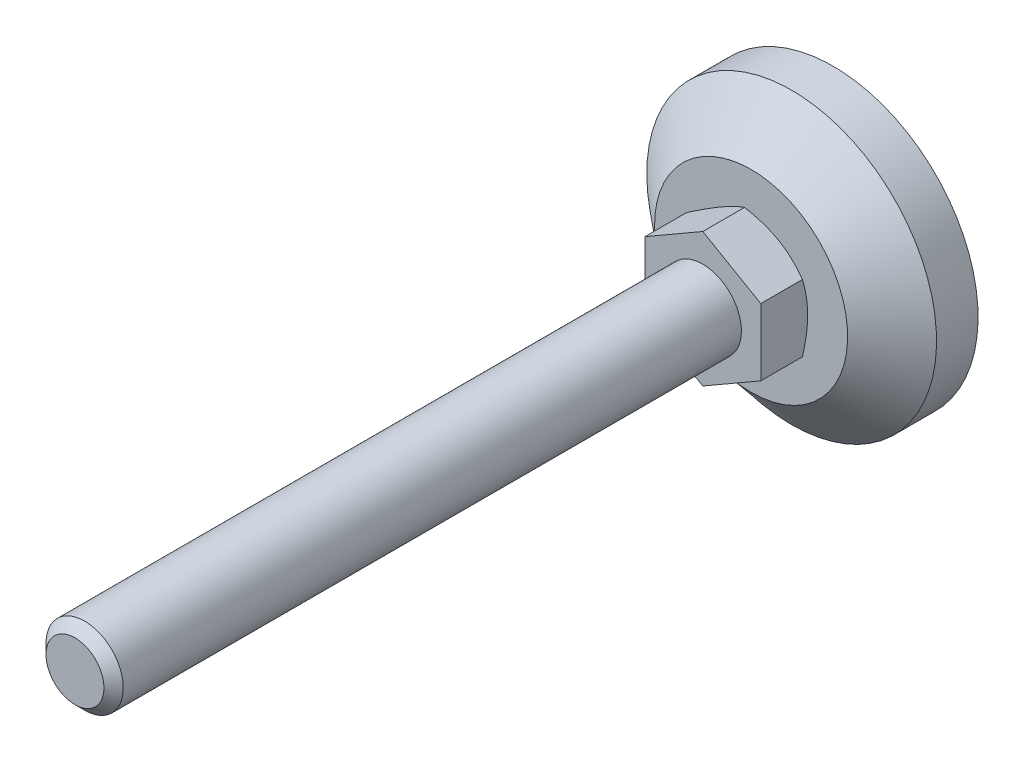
ISO-10303-21;
HEADER;
FILE_DESCRIPTION(('STEP AP214'),'2;1');
FILE_NAME('part.step','',(''),(''),'','','');
FILE_SCHEMA(('AUTOMOTIVE_DESIGN { 1 0 10303 214 1 1 1 1 }'));
ENDSEC;
DATA;
#1=APPLICATION_CONTEXT('core data for automotive mechanical design processes');
#2=APPLICATION_PROTOCOL_DEFINITION('international standard','automotive_design',2000,#1);
#3=PRODUCT_CONTEXT('',#1,'mechanical');
#4=PRODUCT('Part','Part','',(#3));
#5=PRODUCT_RELATED_PRODUCT_CATEGORY('part','',(#4));
#6=PRODUCT_DEFINITION_FORMATION('','',#4);
#7=PRODUCT_DEFINITION_CONTEXT('part definition',#1,'design');
#8=PRODUCT_DEFINITION('design','',#6,#7);
#9=PRODUCT_DEFINITION_SHAPE('','',#8);
#10=(LENGTH_UNIT() NAMED_UNIT(*) SI_UNIT(.MILLI.,.METRE.));
#11=(NAMED_UNIT(*) PLANE_ANGLE_UNIT() SI_UNIT($,.RADIAN.));
#12=(NAMED_UNIT(*) SI_UNIT($,.STERADIAN.) SOLID_ANGLE_UNIT());
#13=UNCERTAINTY_MEASURE_WITH_UNIT(LENGTH_MEASURE(1.E-05),#10,'distance_accuracy_value','');
#14=(GEOMETRIC_REPRESENTATION_CONTEXT(3) GLOBAL_UNCERTAINTY_ASSIGNED_CONTEXT((#13)) GLOBAL_UNIT_ASSIGNED_CONTEXT((#10,
#11,#12)) REPRESENTATION_CONTEXT('',''));
#15=CARTESIAN_POINT('',(0.,0.,0.));
#16=DIRECTION('',(0.,0.,1.));
#17=DIRECTION('',(1.,0.,0.));
#18=AXIS2_PLACEMENT_3D('',#15,#16,#17);
#19=CARTESIAN_POINT('',(0.,0.,27.));
#20=DIRECTION('',(0.,0.,1.));
#21=DIRECTION('',(0.5,-0.866025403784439,0.));
#22=AXIS2_PLACEMENT_3D('',#19,#20,#21);
#23=PLANE('',#22);
#24=DIRECTION('',(0.,1.,0.));
#25=VECTOR('',#24,1.);
#26=CARTESIAN_POINT('',(12.,-6.92820323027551,27.));
#27=LINE('',#26,#25);
#28=CARTESIAN_POINT('',(12.,-6.92820323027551,27.));
#29=VERTEX_POINT('',#28);
#30=CARTESIAN_POINT('',(12.,6.92820323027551,27.));
#31=VERTEX_POINT('',#30);
#32=EDGE_CURVE('E197',#29,#31,#27,.T.);
#33=ORIENTED_EDGE('',*,*,#32,.T.);
#34=DIRECTION('',(-0.866025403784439,0.5,0.));
#35=VECTOR('',#34,1.);
#36=CARTESIAN_POINT('',(12.,6.92820323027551,27.));
#37=LINE('',#36,#35);
#38=CARTESIAN_POINT('',(0.,13.856406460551,27.));
#39=VERTEX_POINT('',#38);
#40=EDGE_CURVE('E320',#31,#39,#37,.T.);
#41=ORIENTED_EDGE('',*,*,#40,.T.);
#42=DIRECTION('',(-0.866025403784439,-0.5,0.));
#43=VECTOR('',#42,1.);
#44=CARTESIAN_POINT('',(0.,13.856406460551,27.));
#45=LINE('',#44,#43);
#46=CARTESIAN_POINT('',(-12.,6.92820323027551,27.));
#47=VERTEX_POINT('',#46);
#48=EDGE_CURVE('E319',#39,#47,#45,.T.);
#49=ORIENTED_EDGE('',*,*,#48,.T.);
#50=DIRECTION('',(0.,-1.,0.));
#51=VECTOR('',#50,1.);
#52=CARTESIAN_POINT('',(-12.,6.92820323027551,27.));
#53=LINE('',#52,#51);
#54=CARTESIAN_POINT('',(-12.,-6.92820323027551,27.));
#55=VERTEX_POINT('',#54);
#56=EDGE_CURVE('E324',#47,#55,#53,.T.);
#57=ORIENTED_EDGE('',*,*,#56,.T.);
#58=DIRECTION('',(0.866025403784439,-0.5,0.));
#59=VECTOR('',#58,1.);
#60=CARTESIAN_POINT('',(-12.,-6.92820323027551,27.));
#61=LINE('',#60,#59);
#62=CARTESIAN_POINT('',(0.,-13.856406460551,27.));
#63=VERTEX_POINT('',#62);
#64=EDGE_CURVE('E326',#55,#63,#61,.T.);
#65=ORIENTED_EDGE('',*,*,#64,.T.);
#66=DIRECTION('',(0.866025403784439,0.5,0.));
#67=VECTOR('',#66,1.);
#68=CARTESIAN_POINT('',(0.,-13.856406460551,27.));
#69=LINE('',#68,#67);
#70=EDGE_CURVE('E37',#63,#29,#69,.T.);
#71=ORIENTED_EDGE('',*,*,#70,.T.);
#72=EDGE_LOOP('',(#33,#41,#49,#57,#65,#71));
#73=FACE_BOUND('',#72,.T.);
#74=CARTESIAN_POINT('',(0.,0.,27.));
#75=DIRECTION('',(0.,0.,1.));
#76=DIRECTION('',(0.5,-0.866025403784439,0.));
#77=AXIS2_PLACEMENT_3D('',#74,#75,#76);
#78=CIRCLE('',#77,8.);
#79=CARTESIAN_POINT('',(4.,-6.92820323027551,27.));
#80=VERTEX_POINT('',#79);
#81=EDGE_CURVE('E201',#80,#80,#78,.T.);
#82=ORIENTED_EDGE('',*,*,#81,.F.);
#83=EDGE_LOOP('',(#82));
#84=FACE_BOUND('',#83,.T.);
#85=ADVANCED_FACE('F14',(#73,#84),#23,.T.);
#86=CARTESIAN_POINT('',(-9.99463491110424,17.3112154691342,17.));
#87=DIRECTION('',(0.,0.,1.));
#88=DIRECTION('',(0.5,-0.866025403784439,0.));
#89=AXIS2_PLACEMENT_3D('',#86,#87,#88);
#90=PLANE('',#89);
#91=CARTESIAN_POINT('',(0.,0.,17.));
#92=DIRECTION('',(0.,0.,-1.));
#93=DIRECTION('',(-0.5,0.866025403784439,0.));
#94=AXIS2_PLACEMENT_3D('',#91,#92,#93);
#95=CIRCLE('',#94,19.9892698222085);
#96=CARTESIAN_POINT('',(-9.99463491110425,17.3112154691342,17.));
#97=VERTEX_POINT('',#96);
#98=EDGE_CURVE('E102',#97,#97,#95,.T.);
#99=ORIENTED_EDGE('',*,*,#98,.F.);
#100=EDGE_LOOP('',(#99));
#101=FACE_BOUND('',#100,.T.);
#102=CARTESIAN_POINT('',(0.,0.,17.));
#103=DIRECTION('',(0.,0.,-1.));
#104=DIRECTION('',(-0.5,0.866025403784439,0.));
#105=AXIS2_PLACEMENT_3D('',#102,#103,#104);
#106=CIRCLE('',#105,11.5);
#107=CARTESIAN_POINT('',(-5.75,9.95929214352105,17.));
#108=VERTEX_POINT('',#107);
#109=EDGE_CURVE('E84',#108,#108,#106,.T.);
#110=ORIENTED_EDGE('',*,*,#109,.T.);
#111=EDGE_LOOP('',(#110));
#112=FACE_BOUND('',#111,.T.);
#113=ADVANCED_FACE('F174',(#101,#112),#90,.T.);
#114=CARTESIAN_POINT('',(0.,0.,0.));
#115=DIRECTION('',(0.,0.,-1.));
#116=DIRECTION('',(-0.5,0.866025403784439,0.));
#117=AXIS2_PLACEMENT_3D('',#114,#115,#116);
#118=PLANE('',#117);
#119=CARTESIAN_POINT('',(0.,0.,0.));
#120=DIRECTION('',(0.,0.,-1.));
#121=DIRECTION('',(-0.5,0.866025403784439,0.));
#122=AXIS2_PLACEMENT_3D('',#119,#120,#121);
#123=CIRCLE('',#122,30.);
#124=CARTESIAN_POINT('',(-15.,25.9807621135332,0.));
#125=VERTEX_POINT('',#124);
#126=EDGE_CURVE('E73',#125,#125,#123,.T.);
#127=ORIENTED_EDGE('',*,*,#126,.T.);
#128=EDGE_LOOP('',(#127));
#129=FACE_BOUND('',#128,.T.);
#130=ADVANCED_FACE('F177',(#129),#118,.T.);
#131=CARTESIAN_POINT('',(0.,0.,-75.4972525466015));
#132=DIRECTION('',(0.,0.,-1.));
#133=DIRECTION('',(-0.5,0.866025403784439,0.));
#134=AXIS2_PLACEMENT_3D('',#131,#132,#133);
#135=CYLINDRICAL_SURFACE('',#134,30.);
#136=CARTESIAN_POINT('',(0.,0.,8.6));
#137=DIRECTION('',(0.,0.,-1.));
#138=DIRECTION('',(-0.5,0.866025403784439,0.));
#139=AXIS2_PLACEMENT_3D('',#136,#137,#138);
#140=CIRCLE('',#139,30.);
#141=CARTESIAN_POINT('',(-15.,25.9807621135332,8.6));
#142=VERTEX_POINT('',#141);
#143=EDGE_CURVE('E105',#142,#142,#140,.T.);
#144=ORIENTED_EDGE('',*,*,#143,.T.);
#145=EDGE_LOOP('',(#144));
#146=FACE_BOUND('',#145,.T.);
#147=ORIENTED_EDGE('',*,*,#126,.F.);
#148=EDGE_LOOP('',(#147));
#149=FACE_BOUND('',#148,.T.);
#150=ADVANCED_FACE('F181',(#146,#149),#135,.T.);
#151=CARTESIAN_POINT('',(0.,0.,8.6));
#152=DIRECTION('',(0.,0.,-1.));
#153=DIRECTION('',(-0.5,0.866025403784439,0.));
#154=AXIS2_PLACEMENT_3D('',#151,#152,#153);
#155=CONICAL_SURFACE('',#154,30.,0.872664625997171);
#156=ORIENTED_EDGE('',*,*,#98,.T.);
#157=EDGE_LOOP('',(#156));
#158=FACE_BOUND('',#157,.T.);
#159=ORIENTED_EDGE('',*,*,#143,.F.);
#160=EDGE_LOOP('',(#159));
#161=FACE_BOUND('',#160,.T.);
#162=ADVANCED_FACE('F121',(#158,#161),#155,.T.);
#163=CARTESIAN_POINT('',(0.,0.,20.8975219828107));
#164=DIRECTION('',(0.,0.,1.));
#165=DIRECTION('',(0.5,-0.866025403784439,0.));
#166=AXIS2_PLACEMENT_3D('',#163,#164,#165);
#167=CONICAL_SURFACE('',#166,18.2507060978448,1.0471975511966);
#168=ORIENTED_EDGE('',*,*,#109,.F.);
#169=EDGE_LOOP('',(#168));
#170=FACE_BOUND('',#169,.T.);
#171=CARTESIAN_POINT('',(-10.1845483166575,-19.7364581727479,23.1830146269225));
#172=CARTESIAN_POINT('',(-9.95731802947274,-19.6052667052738,23.0555465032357));
#173=CARTESIAN_POINT('',(-9.72982292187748,-19.4739223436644,22.9287081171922));
#174=CARTESIAN_POINT('',(-9.27424782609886,-19.2108959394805,22.6764332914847));
#175=CARTESIAN_POINT('',(-9.04616783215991,-19.0792138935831,22.5509968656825));
#176=CARTESIAN_POINT('',(-8.360907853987,-18.6835788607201,22.1769716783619));
#177=CARTESIAN_POINT('',(-7.90277404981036,-18.4190751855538,21.930704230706));
#178=CARTESIAN_POINT('',(-6.98100239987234,-17.8868900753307,21.4445247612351));
#179=CARTESIAN_POINT('',(-6.51734820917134,-17.6191992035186,21.2046539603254));
#180=CARTESIAN_POINT('',(-5.58637620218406,-17.0817022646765,20.734620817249));
#181=CARTESIAN_POINT('',(-5.11905855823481,-16.8118962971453,20.5044580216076));
#182=CARTESIAN_POINT('',(-4.16467967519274,-16.2608853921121,20.0490896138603));
#183=CARTESIAN_POINT('',(-3.67747196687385,-15.9795958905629,19.82429119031));
#184=CARTESIAN_POINT('',(-2.69737824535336,-15.413738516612,19.3915182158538));
#185=CARTESIAN_POINT('',(-2.20449160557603,-15.1291702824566,19.1835455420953));
#186=CARTESIAN_POINT('',(-1.21317256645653,-14.5568319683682,18.7898295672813));
#187=CARTESIAN_POINT('',(-0.714753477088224,-14.2690695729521,18.6040419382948));
#188=CARTESIAN_POINT('',(0.289281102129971,-13.6893899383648,18.2605950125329));
#189=CARTESIAN_POINT('',(0.794894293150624,-13.3974740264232,18.1029269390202));
#190=CARTESIAN_POINT('',(1.55740346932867,-12.9572391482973,17.8936125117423));
#191=CARTESIAN_POINT('',(1.81154649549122,-12.8105096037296,17.82851512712));
#192=CARTESIAN_POINT('',(2.3215816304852,-12.5160406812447,17.7081511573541));
#193=CARTESIAN_POINT('',(2.57747370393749,-12.3683013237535,17.652884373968));
#194=CARTESIAN_POINT('',(3.09083535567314,-12.0719118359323,17.5531523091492));
#195=CARTESIAN_POINT('',(3.34830490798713,-11.9232617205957,17.5086868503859));
#196=CARTESIAN_POINT('',(3.86455433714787,-11.6252049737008,17.4314414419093));
#197=CARTESIAN_POINT('',(4.12333416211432,-11.4757983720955,17.3986610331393));
#198=CARTESIAN_POINT('',(4.63843364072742,-11.1784055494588,17.345852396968));
#199=CARTESIAN_POINT('',(4.89474072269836,-11.0304265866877,17.3256616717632));
#200=CARTESIAN_POINT('',(5.40786438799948,-10.7341745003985,17.2978182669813));
#201=CARTESIAN_POINT('',(5.66468096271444,-10.5859013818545,17.2901653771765));
#202=CARTESIAN_POINT('',(6.17836497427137,-10.2893257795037,17.287579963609));
#203=CARTESIAN_POINT('',(6.43523241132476,-10.1410232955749,17.2926474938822));
#204=CARTESIAN_POINT('',(6.94855188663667,-9.84465815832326,17.3153783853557));
#205=CARTESIAN_POINT('',(7.20500390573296,-9.69659551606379,17.3330423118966));
#206=CARTESIAN_POINT('',(7.81927447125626,-9.34194623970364,17.3900614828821));
#207=CARTESIAN_POINT('',(8.17669346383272,-9.13559028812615,17.4352607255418));
#208=CARTESIAN_POINT('',(8.88892563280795,-8.72438285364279,17.5476838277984));
#209=CARTESIAN_POINT('',(9.24373845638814,-8.51953157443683,17.6149106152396));
#210=CARTESIAN_POINT('',(9.95040329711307,-8.11153843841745,17.7689975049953));
#211=CARTESIAN_POINT('',(10.3022528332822,-7.90839801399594,17.8558726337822));
#212=CARTESIAN_POINT('',(11.0024455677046,-7.50414155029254,18.0466010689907));
#213=CARTESIAN_POINT('',(11.3507888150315,-7.30302548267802,18.1504541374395));
#214=CARTESIAN_POINT('',(12.0517118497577,-6.89834737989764,18.3750877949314));
#215=CARTESIAN_POINT('',(12.4042127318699,-6.69483090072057,18.4961943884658));
#216=CARTESIAN_POINT('',(13.1057427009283,-6.28980238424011,18.7510771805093));
#217=CARTESIAN_POINT('',(13.4547717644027,-6.08829036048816,18.8848534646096));
#218=CARTESIAN_POINT('',(14.1495287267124,-5.68717224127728,19.1629377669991));
#219=CARTESIAN_POINT('',(14.4952576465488,-5.48756555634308,19.3072424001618));
#220=CARTESIAN_POINT('',(15.1838410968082,-5.09001171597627,19.6046702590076));
#221=CARTESIAN_POINT('',(15.5266956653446,-4.89206453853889,19.7577933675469));
#222=CARTESIAN_POINT('',(16.3531119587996,-4.41493286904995,20.1371587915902));
#223=CARTESIAN_POINT('',(16.8353860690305,-4.13649178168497,20.3671360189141));
#224=CARTESIAN_POINT('',(17.7956874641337,-3.58206151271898,20.838658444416));
#225=CARTESIAN_POINT('',(18.2737144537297,-3.3060725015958,21.0802044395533));
#226=CARTESIAN_POINT('',(19.2263411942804,-2.75607319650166,21.572480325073));
#227=CARTESIAN_POINT('',(19.7009400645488,-2.48206341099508,21.8232124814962));
#228=CARTESIAN_POINT('',(20.647182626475,-1.93575001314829,22.3319518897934));
#229=CARTESIAN_POINT('',(21.1188263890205,-1.66344635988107,22.5899589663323));
#230=CARTESIAN_POINT('',(22.060219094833,-1.11993302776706,23.1121588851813));
#231=CARTESIAN_POINT('',(22.5299651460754,-0.848725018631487,23.3763586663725));
#232=CARTESIAN_POINT('',(23.4674052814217,-0.307493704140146,23.9095679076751));
#233=CARTESIAN_POINT('',(23.9350993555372,-0.037470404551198,24.1785773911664));
#234=CARTESIAN_POINT('',(24.8686924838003,0.50153983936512,24.7205226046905));
#235=CARTESIAN_POINT('',(25.3345917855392,0.770526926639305,24.9934577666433));
#236=CARTESIAN_POINT('',(26.2649273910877,1.30765643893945,25.5426344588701));
#237=CARTESIAN_POINT('',(26.7293636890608,1.57579886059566,25.8188760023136));
#238=CARTESIAN_POINT('',(28.0397530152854,2.33235249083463,26.6032315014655));
#239=CARTESIAN_POINT('',(28.8842584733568,2.81992794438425,27.1145698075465));
#240=CARTESIAN_POINT('',(30.5701660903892,3.79328716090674,28.1440983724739));
#241=CARTESIAN_POINT('',(31.4115681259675,4.27907085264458,28.6622889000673));
#242=CARTESIAN_POINT('',(33.0897202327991,5.24795242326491,29.7025139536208));
#243=CARTESIAN_POINT('',(33.9264767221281,5.73105400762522,30.2245346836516));
#244=CARTESIAN_POINT('',(35.1801565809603,6.45486641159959,31.0105887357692));
#245=CARTESIAN_POINT('',(35.5977953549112,6.69599027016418,31.2731029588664));
#246=CARTESIAN_POINT('',(36.4326440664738,7.17799039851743,31.7990373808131));
#247=CARTESIAN_POINT('',(36.8498540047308,7.41886666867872,32.0624575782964));
#248=CARTESIAN_POINT('',(37.2668741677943,7.65963337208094,32.3262778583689));
#249=B_SPLINE_CURVE_WITH_KNOTS('',3,(#171,#172,#173,#174,#175,#176,#177,#178,#179,#180,#181,
#182,#183,#184,#185,#186,#187,#188,#189,#190,#191,#192,#193,#194,#195,#196,#197,#198,#199,#200,
#201,#202,#203,#204,#205,#206,#207,#208,#209,#210,#211,#212,#213,#214,#215,#216,#217,#218,#219,
#220,#221,#222,#223,#224,#225,#226,#227,#228,#229,#230,#231,#232,#233,#234,#235,#236,#237,#238,
#239,#240,#241,#242,#243,#244,#245,#246,#247,#248),.UNSPECIFIED.,.F.,.F.,(4,2,2,2,2,2,2,2,2,2,2,
2,2,2,2,2,2,2,2,2,2,2,2,2,2,2,2,2,2,2,2,2,2,2,2,2,2,2,4),(0.,0.875119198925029,1.75024704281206,
3.50075771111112,5.26066680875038,7.02049360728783,8.8377767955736,10.6552624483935,
12.469053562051,14.2822775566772,15.1839173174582,16.085538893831,16.9871456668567,
17.8887170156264,18.7783966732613,19.6680614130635,20.5577299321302,21.4474383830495,
22.6922901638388,23.9373074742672,25.1832801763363,26.4292354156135,27.7029922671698,
28.9767577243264,30.2501154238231,31.5234562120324,33.3307782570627,35.1382249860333,
36.9461206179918,38.7539727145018,40.5639577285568,42.3739515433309,44.1836860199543,
45.9934277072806,49.2966384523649,52.5999791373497,55.8945808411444,57.5417866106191,
59.1889898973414),.UNSPECIFIED.);
#250=CARTESIAN_POINT('',(0.,-13.856406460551,18.3604719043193));
#251=VERTEX_POINT('',#250);
#252=CARTESIAN_POINT('',(12.,-6.92820323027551,18.3604719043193));
#253=VERTEX_POINT('',#252);
#254=EDGE_CURVE('E65',#251,#253,#249,.T.);
#255=ORIENTED_EDGE('',*,*,#254,.F.);
#256=CARTESIAN_POINT('',(-12.0002,-6.92808776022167,18.3605385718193));
#257=CARTESIAN_POINT('',(-11.7364142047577,-7.08038456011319,18.2726247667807));
#258=CARTESIAN_POINT('',(-11.4716448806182,-7.2332492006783,18.1887011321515));
#259=CARTESIAN_POINT('',(-10.9399829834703,-7.54020434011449,18.0299413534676));
#260=CARTESIAN_POINT('',(-10.6730897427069,-7.69429522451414,17.9551081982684));
#261=CARTESIAN_POINT('',(-9.86810959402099,-8.15905073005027,17.7456926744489));
#262=CARTESIAN_POINT('',(-9.3268449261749,-8.47155003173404,17.6265783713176));
#263=CARTESIAN_POINT('',(-8.51686717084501,-8.93919090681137,17.4869061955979));
#264=CARTESIAN_POINT('',(-8.25057389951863,-9.09293539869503,17.4471189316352));
#265=CARTESIAN_POINT('',(-7.71675440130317,-9.40113622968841,17.3803985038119));
#266=CARTESIAN_POINT('',(-7.44922815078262,-9.55559258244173,17.3534655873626));
#267=CARTESIAN_POINT('',(-6.91372963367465,-9.86476279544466,17.3131437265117));
#268=CARTESIAN_POINT('',(-6.64575827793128,-10.0194761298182,17.2997386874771));
#269=CARTESIAN_POINT('',(-6.10956726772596,-10.3290461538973,17.286758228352));
#270=CARTESIAN_POINT('',(-5.84134762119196,-10.4839028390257,17.2871823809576));
#271=CARTESIAN_POINT('',(-5.33991062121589,-10.7734076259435,17.3008951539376));
#272=CARTESIAN_POINT('',(-5.10665750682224,-10.908076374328,17.3125111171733));
#273=CARTESIAN_POINT('',(-4.64068775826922,-11.1771041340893,17.3459831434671));
#274=CARTESIAN_POINT('',(-4.40797116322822,-11.3114631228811,17.367839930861));
#275=CARTESIAN_POINT('',(-3.94320092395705,-11.5797983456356,17.4214125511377));
#276=CARTESIAN_POINT('',(-3.71114798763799,-11.7137741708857,17.4531365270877));
#277=CARTESIAN_POINT('',(-3.24813003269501,-11.9810977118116,17.5258869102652));
#278=CARTESIAN_POINT('',(-3.01716508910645,-12.1144453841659,17.566913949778));
#279=CARTESIAN_POINT('',(-2.31605804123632,-12.5192297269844,17.7049867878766));
#280=CARTESIAN_POINT('',(-1.84794625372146,-12.789494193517,17.8158000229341));
#281=CARTESIAN_POINT('',(-0.918702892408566,-13.3259930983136,18.0673009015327));
#282=CARTESIAN_POINT('',(-0.457559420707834,-13.5922344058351,18.2079294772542));
#283=CARTESIAN_POINT('',(0.000200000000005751,-13.8565219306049,18.3605385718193));
#284=B_SPLINE_CURVE_WITH_KNOTS('',3,(#256,#257,#258,#259,#260,#261,#262,#263,#264,#265,#266,
#267,#268,#269,#270,#271,#272,#273,#274,#275,#276,#277,#278,#279,#280,#281,#282,#283),
.UNSPECIFIED.,.F.,.F.,(4,2,2,2,2,2,2,2,2,2,2,2,2,4),(0.,0.951004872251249,1.90232158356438,
3.80900466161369,4.73894551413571,5.6689042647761,6.59775529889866,7.52657763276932,
8.3351464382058,9.14377244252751,9.95306755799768,10.7624176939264,12.4167102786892,
14.0677556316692),.UNSPECIFIED.);
#285=CARTESIAN_POINT('',(-12.,-6.92820323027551,18.3604719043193));
#286=VERTEX_POINT('',#285);
#287=EDGE_CURVE('E68',#286,#251,#284,.T.);
#288=ORIENTED_EDGE('',*,*,#287,.F.);
#289=CARTESIAN_POINT('',(-12.,6.92843417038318,18.3605385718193));
#290=CARTESIAN_POINT('',(-12.,6.62384057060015,18.2726247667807));
#291=CARTESIAN_POINT('',(-12.,6.31811128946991,18.1887011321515));
#292=CARTESIAN_POINT('',(-12.,5.70420101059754,18.0299413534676));
#293=CARTESIAN_POINT('',(-12.,5.39601924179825,17.9551081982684));
#294=CARTESIAN_POINT('',(-12.,4.46650823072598,17.7456926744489));
#295=CARTESIAN_POINT('',(-12.,3.84150962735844,17.6265783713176));
#296=CARTESIAN_POINT('',(-12.,2.90622787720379,17.4869061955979));
#297=CARTESIAN_POINT('',(-12.,2.59873889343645,17.4471189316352));
#298=CARTESIAN_POINT('',(-12.,1.98233723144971,17.3803985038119));
#299=CARTESIAN_POINT('',(-12.,1.67342452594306,17.3534655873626));
#300=CARTESIAN_POINT('',(-12.,1.05508409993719,17.3131437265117));
#301=CARTESIAN_POINT('',(-12.,0.745657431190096,17.2997386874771));
#302=CARTESIAN_POINT('',(-12.,0.126517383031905,17.286758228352));
#303=CARTESIAN_POINT('',(-12.,-0.183195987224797,17.2871823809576));
#304=CARTESIAN_POINT('',(-12.,-0.76220556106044,17.3008951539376));
#305=CARTESIAN_POINT('',(-12.,-1.03154305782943,17.3125111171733));
#306=CARTESIAN_POINT('',(-12.,-1.56959857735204,17.3459831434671));
#307=CARTESIAN_POINT('',(-12.,-1.83831655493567,17.367839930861));
#308=CARTESIAN_POINT('',(-12.,-2.37498700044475,17.4214125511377));
#309=CARTESIAN_POINT('',(-12.,-2.64293865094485,17.4531365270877));
#310=CARTESIAN_POINT('',(-12.,-3.17758573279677,17.5258869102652));
#311=CARTESIAN_POINT('',(-12.,-3.44428107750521,17.566913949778));
#312=CARTESIAN_POINT('',(-12.,-4.25384976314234,17.7049867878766));
#313=CARTESIAN_POINT('',(-12.,-4.79437869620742,17.8158000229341));
#314=CARTESIAN_POINT('',(-12.,-5.86737650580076,18.0673009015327));
#315=CARTESIAN_POINT('',(-12.,-6.39985912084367,18.2079294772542));
#316=CARTESIAN_POINT('',(-12.,-6.92843417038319,18.3605385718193));
#317=B_SPLINE_CURVE_WITH_KNOTS('',3,(#289,#290,#291,#292,#293,#294,#295,#296,#297,#298,#299,
#300,#301,#302,#303,#304,#305,#306,#307,#308,#309,#310,#311,#312,#313,#314,#315,#316),
.UNSPECIFIED.,.F.,.F.,(4,2,2,2,2,2,2,2,2,2,2,2,2,4),(0.,0.951004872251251,1.90232158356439,
3.80900466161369,4.73894551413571,5.6689042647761,6.59775529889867,7.52657763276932,
8.3351464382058,9.14377244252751,9.95306755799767,10.7624176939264,12.4167102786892,
14.0677556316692),.UNSPECIFIED.);
#318=CARTESIAN_POINT('',(-12.,6.92820323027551,18.3604719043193));
#319=VERTEX_POINT('',#318);
#320=EDGE_CURVE('E83',#319,#286,#317,.T.);
#321=ORIENTED_EDGE('',*,*,#320,.F.);
#322=CARTESIAN_POINT('',(-22.184548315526,1.04815151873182,23.1830146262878));
#323=CARTESIAN_POINT('',(-21.9573180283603,1.179342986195,23.0555465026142));
#324=CARTESIAN_POINT('',(-21.729822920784,1.31068734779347,22.9287081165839));
#325=CARTESIAN_POINT('',(-21.2742478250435,1.57371375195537,22.676433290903));
#326=CARTESIAN_POINT('',(-21.0461678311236,1.7053957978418,22.550996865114));
#327=CARTESIAN_POINT('',(-20.3609078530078,2.1010308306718,22.1769716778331));
#328=CARTESIAN_POINT('',(-19.9027740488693,2.36553450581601,21.9307042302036));
#329=CARTESIAN_POINT('',(-18.9810023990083,2.89771961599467,21.4445247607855));
#330=CARTESIAN_POINT('',(-18.517348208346,3.16541048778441,21.2046539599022));
#331=CARTESIAN_POINT('',(-17.5863762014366,3.7029074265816,20.7346208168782));
#332=CARTESIAN_POINT('',(-17.1190585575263,3.97271339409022,20.5044580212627));
#333=CARTESIAN_POINT('',(-16.1646796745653,4.52372429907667,20.0490896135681));
#334=CARTESIAN_POINT('',(-15.6774719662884,4.80501380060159,19.8242911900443));
#335=CARTESIAN_POINT('',(-14.6973782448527,5.37087117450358,19.3915182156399));
#336=CARTESIAN_POINT('',(-14.2044916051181,5.65543940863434,19.1835455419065));
#337=CARTESIAN_POINT('',(-13.2131725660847,6.22777772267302,18.7898295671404));
#338=CARTESIAN_POINT('',(-12.7147534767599,6.51554011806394,18.6040419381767));
#339=CARTESIAN_POINT('',(-11.7107188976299,7.09521975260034,18.2605950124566));
#340=CARTESIAN_POINT('',(-11.2051057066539,7.38713566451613,18.1029269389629));
#341=CARTESIAN_POINT('',(-10.4425965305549,7.82737054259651,17.8936125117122));
#342=CARTESIAN_POINT('',(-10.1884535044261,7.97410008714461,17.8285151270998));
#343=CARTESIAN_POINT('',(-9.67841836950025,8.26856900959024,17.7081511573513));
#344=CARTESIAN_POINT('',(-9.42252629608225,8.41630836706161,17.6528843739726));
#345=CARTESIAN_POINT('',(-8.90916464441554,8.71269785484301,17.5531523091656));
#346=CARTESIAN_POINT('',(-8.6516950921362,8.86134797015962,17.5086868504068));
#347=CARTESIAN_POINT('',(-8.13544566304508,9.15940471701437,17.4314414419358));
#348=CARTESIAN_POINT('',(-7.87666583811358,9.30881131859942,17.3986610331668));
#349=CARTESIAN_POINT('',(-7.36156635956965,9.60620414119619,17.3458523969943));
#350=CARTESIAN_POINT('',(-7.10525927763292,9.75418310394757,17.3256616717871));
#351=CARTESIAN_POINT('',(-6.59213561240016,10.0504351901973,17.2978182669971));
#352=CARTESIAN_POINT('',(-6.33531903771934,10.1987083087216,17.2901653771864));
#353=CARTESIAN_POINT('',(-5.82163502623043,10.4952839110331,17.2875799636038));
#354=CARTESIAN_POINT('',(-5.56476758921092,10.6435863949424,17.2926474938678));
#355=CARTESIAN_POINT('',(-5.05144811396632,10.9399515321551,17.3153783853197));
#356=CARTESIAN_POINT('',(-4.79499609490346,11.0880141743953,17.3330423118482));
#357=CARTESIAN_POINT('',(-4.18072552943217,11.4426634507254,17.3900614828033));
#358=CARTESIAN_POINT('',(-3.82330653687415,11.6490194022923,17.4352607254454));
#359=CARTESIAN_POINT('',(-3.11107436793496,12.0602268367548,17.547683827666));
#360=CARTESIAN_POINT('',(-2.75626154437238,12.2650781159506,17.6149106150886));
#361=CARTESIAN_POINT('',(-2.04959670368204,12.67307125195,17.768997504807));
#362=CARTESIAN_POINT('',(-1.69774716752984,12.8762116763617,17.8558726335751));
#363=CARTESIAN_POINT('',(-0.997554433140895,13.2804681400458,18.0466010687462));
#364=CARTESIAN_POINT('',(-0.649211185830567,13.4815842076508,18.1504541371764));
#365=CARTESIAN_POINT('',(0.0517118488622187,13.8862623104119,18.3750877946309));
#366=CARTESIAN_POINT('',(0.404212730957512,14.0897787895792,18.4961943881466));
#367=CARTESIAN_POINT('',(1.10574269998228,14.4948073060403,18.7510771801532));
#368=CARTESIAN_POINT('',(1.45477176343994,14.6963193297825,18.8848534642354));
#369=CARTESIAN_POINT('',(2.1495287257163,15.0974374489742,19.1629377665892));
#370=CARTESIAN_POINT('',(2.49525764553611,15.2970441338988,19.3072423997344));
#371=CARTESIAN_POINT('',(3.18384109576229,15.6945979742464,19.6046702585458));
#372=CARTESIAN_POINT('',(3.52669566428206,15.8925451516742,19.7577933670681));
#373=CARTESIAN_POINT('',(4.3531119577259,16.3696768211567,20.1371587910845));
#374=CARTESIAN_POINT('',(4.83538606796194,16.6481179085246,20.3671360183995));
#375=CARTESIAN_POINT('',(5.7956874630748,17.2025481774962,20.838658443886));
#376=CARTESIAN_POINT('',(6.27371445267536,17.478537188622,21.0802044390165));
#377=CARTESIAN_POINT('',(7.22634119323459,18.0285364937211,21.5724803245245));
#378=CARTESIAN_POINT('',(7.7009400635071,18.30254627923,21.8232124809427));
#379=CARTESIAN_POINT('',(8.64718262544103,18.8488596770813,22.3319518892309));
#380=CARTESIAN_POINT('',(9.11882638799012,19.1211633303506,22.589958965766));
#381=CARTESIAN_POINT('',(10.0602190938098,19.6646766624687,23.1121588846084));
#382=CARTESIAN_POINT('',(10.5299651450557,19.9358846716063,23.3763586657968));
#383=CARTESIAN_POINT('',(11.4674052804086,20.4771159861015,23.9095679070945));
#384=CARTESIAN_POINT('',(11.9350993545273,20.7471392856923,24.1785773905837));
#385=CARTESIAN_POINT('',(12.8686924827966,21.2861495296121,24.7205226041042));
#386=CARTESIAN_POINT('',(13.3345917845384,21.555136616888,24.9934577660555));
#387=CARTESIAN_POINT('',(14.2649273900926,22.0922661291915,25.5426344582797));
#388=CARTESIAN_POINT('',(14.7293636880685,22.3604085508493,25.8188760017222));
#389=CARTESIAN_POINT('',(16.0397530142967,23.1169621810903,26.6032315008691));
#390=CARTESIAN_POINT('',(16.8842584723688,23.6045376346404,27.1145698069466));
#391=CARTESIAN_POINT('',(18.5701660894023,24.5778968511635,28.1440983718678));
#392=CARTESIAN_POINT('',(19.411568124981,25.0636805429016,28.6622888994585));
#393=CARTESIAN_POINT('',(21.0897202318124,26.0325621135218,29.7025139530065));
#394=CARTESIAN_POINT('',(21.9264767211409,26.5156636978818,30.2245346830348));
#395=CARTESIAN_POINT('',(23.1801565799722,27.2394761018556,31.0105887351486));
#396=CARTESIAN_POINT('',(23.5977953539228,27.48059996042,31.2731029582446));
#397=CARTESIAN_POINT('',(24.4326440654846,27.9626000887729,31.799037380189));
#398=CARTESIAN_POINT('',(24.8498540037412,28.2034763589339,32.0624575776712));
#399=CARTESIAN_POINT('',(25.2668741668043,28.4442430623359,32.3262778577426));
#400=B_SPLINE_CURVE_WITH_KNOTS('',3,(#322,#323,#324,#325,#326,#327,#328,#329,#330,#331,#332,
#333,#334,#335,#336,#337,#338,#339,#340,#341,#342,#343,#344,#345,#346,#347,#348,#349,#350,#351,
#352,#353,#354,#355,#356,#357,#358,#359,#360,#361,#362,#363,#364,#365,#366,#367,#368,#369,#370,
#371,#372,#373,#374,#375,#376,#377,#378,#379,#380,#381,#382,#383,#384,#385,#386,#387,#388,#389,
#390,#391,#392,#393,#394,#395,#396,#397,#398,#399),.UNSPECIFIED.,.F.,.F.,(4,2,2,2,2,2,2,2,2,2,2,
2,2,2,2,2,2,2,2,2,2,2,2,2,2,2,2,2,2,2,2,2,2,2,2,2,2,2,4),(0.,0.875119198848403,1.7502470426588,
3.50075771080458,5.2606668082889,7.02049360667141,8.83777679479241,10.6552624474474,
12.4690535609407,14.2822775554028,15.183917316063,16.085538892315,16.9871456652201,
17.8887170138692,18.7783966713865,19.668061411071,20.55772993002,21.4474383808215,
22.6922901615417,23.9373074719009,25.1832801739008,26.4292354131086,27.7029922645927,
28.9767577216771,30.2501154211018,31.523456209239,33.3307782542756,35.1382249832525,
36.9461206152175,38.7539727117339,40.5639577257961,42.3739515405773,44.1836860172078,
45.9934277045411,49.2966384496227,52.5999791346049,55.8945808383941,57.541786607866,
59.1889898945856),.UNSPECIFIED.);
#401=CARTESIAN_POINT('',(0.,13.856406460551,18.3604719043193));
#402=VERTEX_POINT('',#401);
#403=EDGE_CURVE('E143',#402,#319,#400,.F.);
#404=ORIENTED_EDGE('',*,*,#403,.F.);
#405=CARTESIAN_POINT('',(12.0002,6.92808776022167,18.3605385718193));
#406=CARTESIAN_POINT('',(11.7364142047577,7.08038456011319,18.2726247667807));
#407=CARTESIAN_POINT('',(11.4716448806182,7.2332492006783,18.1887011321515));
#408=CARTESIAN_POINT('',(10.9399829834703,7.54020434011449,18.0299413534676));
#409=CARTESIAN_POINT('',(10.6730897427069,7.69429522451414,17.9551081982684));
#410=CARTESIAN_POINT('',(9.86810959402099,8.15905073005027,17.7456926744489));
#411=CARTESIAN_POINT('',(9.3268449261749,8.47155003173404,17.6265783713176));
#412=CARTESIAN_POINT('',(8.51686717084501,8.93919090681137,17.4869061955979));
#413=CARTESIAN_POINT('',(8.25057389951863,9.09293539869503,17.4471189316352));
#414=CARTESIAN_POINT('',(7.71675440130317,9.40113622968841,17.3803985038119));
#415=CARTESIAN_POINT('',(7.44922815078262,9.55559258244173,17.3534655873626));
#416=CARTESIAN_POINT('',(6.91372963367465,9.86476279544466,17.3131437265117));
#417=CARTESIAN_POINT('',(6.64575827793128,10.0194761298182,17.2997386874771));
#418=CARTESIAN_POINT('',(6.10956726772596,10.3290461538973,17.286758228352));
#419=CARTESIAN_POINT('',(5.84134762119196,10.4839028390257,17.2871823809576));
#420=CARTESIAN_POINT('',(5.33991062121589,10.7734076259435,17.3008951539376));
#421=CARTESIAN_POINT('',(5.10665750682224,10.908076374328,17.3125111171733));
#422=CARTESIAN_POINT('',(4.64068775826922,11.1771041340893,17.3459831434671));
#423=CARTESIAN_POINT('',(4.40797116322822,11.3114631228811,17.367839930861));
#424=CARTESIAN_POINT('',(3.94320092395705,11.5797983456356,17.4214125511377));
#425=CARTESIAN_POINT('',(3.71114798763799,11.7137741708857,17.4531365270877));
#426=CARTESIAN_POINT('',(3.24813003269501,11.9810977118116,17.5258869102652));
#427=CARTESIAN_POINT('',(3.01716508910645,12.1144453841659,17.566913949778));
#428=CARTESIAN_POINT('',(2.31605804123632,12.5192297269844,17.7049867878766));
#429=CARTESIAN_POINT('',(1.84794625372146,12.789494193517,17.8158000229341));
#430=CARTESIAN_POINT('',(0.918702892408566,13.3259930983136,18.0673009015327));
#431=CARTESIAN_POINT('',(0.457559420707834,13.5922344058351,18.2079294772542));
#432=CARTESIAN_POINT('',(-0.000200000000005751,13.8565219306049,18.3605385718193));
#433=B_SPLINE_CURVE_WITH_KNOTS('',3,(#405,#406,#407,#408,#409,#410,#411,#412,#413,#414,#415,
#416,#417,#418,#419,#420,#421,#422,#423,#424,#425,#426,#427,#428,#429,#430,#431,#432),
.UNSPECIFIED.,.F.,.F.,(4,2,2,2,2,2,2,2,2,2,2,2,2,4),(0.,0.951004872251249,1.90232158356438,
3.80900466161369,4.73894551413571,5.6689042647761,6.59775529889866,7.52657763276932,
8.3351464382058,9.14377244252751,9.95306755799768,10.7624176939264,12.4167102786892,
14.0677556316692),.UNSPECIFIED.);
#434=CARTESIAN_POINT('',(12.,6.92820323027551,18.3604719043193));
#435=VERTEX_POINT('',#434);
#436=EDGE_CURVE('E150',#435,#402,#433,.T.);
#437=ORIENTED_EDGE('',*,*,#436,.F.);
#438=CARTESIAN_POINT('',(12.,-6.92843417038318,18.3605385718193));
#439=CARTESIAN_POINT('',(12.,-6.62384057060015,18.2726247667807));
#440=CARTESIAN_POINT('',(12.,-6.31811128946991,18.1887011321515));
#441=CARTESIAN_POINT('',(12.,-5.70420101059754,18.0299413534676));
#442=CARTESIAN_POINT('',(12.,-5.39601924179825,17.9551081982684));
#443=CARTESIAN_POINT('',(12.,-4.46650823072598,17.7456926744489));
#444=CARTESIAN_POINT('',(12.,-3.84150962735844,17.6265783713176));
#445=CARTESIAN_POINT('',(12.,-2.90622787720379,17.4869061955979));
#446=CARTESIAN_POINT('',(12.,-2.59873889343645,17.4471189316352));
#447=CARTESIAN_POINT('',(12.,-1.98233723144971,17.3803985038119));
#448=CARTESIAN_POINT('',(12.,-1.67342452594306,17.3534655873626));
#449=CARTESIAN_POINT('',(12.,-1.05508409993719,17.3131437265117));
#450=CARTESIAN_POINT('',(12.,-0.745657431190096,17.2997386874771));
#451=CARTESIAN_POINT('',(12.,-0.126517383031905,17.286758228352));
#452=CARTESIAN_POINT('',(12.,0.183195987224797,17.2871823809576));
#453=CARTESIAN_POINT('',(12.,0.76220556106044,17.3008951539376));
#454=CARTESIAN_POINT('',(12.,1.03154305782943,17.3125111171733));
#455=CARTESIAN_POINT('',(12.,1.56959857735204,17.3459831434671));
#456=CARTESIAN_POINT('',(12.,1.83831655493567,17.367839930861));
#457=CARTESIAN_POINT('',(12.,2.37498700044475,17.4214125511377));
#458=CARTESIAN_POINT('',(12.,2.64293865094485,17.4531365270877));
#459=CARTESIAN_POINT('',(12.,3.17758573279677,17.5258869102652));
#460=CARTESIAN_POINT('',(12.,3.44428107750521,17.566913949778));
#461=CARTESIAN_POINT('',(12.,4.25384976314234,17.7049867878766));
#462=CARTESIAN_POINT('',(12.,4.79437869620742,17.8158000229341));
#463=CARTESIAN_POINT('',(12.,5.86737650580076,18.0673009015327));
#464=CARTESIAN_POINT('',(12.,6.39985912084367,18.2079294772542));
#465=CARTESIAN_POINT('',(12.,6.92843417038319,18.3605385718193));
#466=B_SPLINE_CURVE_WITH_KNOTS('',3,(#438,#439,#440,#441,#442,#443,#444,#445,#446,#447,#448,
#449,#450,#451,#452,#453,#454,#455,#456,#457,#458,#459,#460,#461,#462,#463,#464,#465),
.UNSPECIFIED.,.F.,.F.,(4,2,2,2,2,2,2,2,2,2,2,2,2,4),(0.,0.951004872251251,1.90232158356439,
3.80900466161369,4.73894551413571,5.6689042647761,6.59775529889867,7.52657763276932,
8.3351464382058,9.14377244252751,9.95306755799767,10.7624176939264,12.4167102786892,
14.0677556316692),.UNSPECIFIED.);
#467=EDGE_CURVE('E29',#253,#435,#466,.T.);
#468=ORIENTED_EDGE('',*,*,#467,.F.);
#469=EDGE_LOOP('',(#255,#288,#321,#404,#437,#468));
#470=FACE_BOUND('',#469,.T.);
#471=ADVANCED_FACE('F67',(#170,#470),#167,.T.);
#472=CARTESIAN_POINT('',(0.,-13.856406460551,27.));
#473=DIRECTION('',(-0.5,0.866025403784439,0.));
#474=DIRECTION('',(-0.866025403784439,-0.5,0.));
#475=AXIS2_PLACEMENT_3D('',#472,#473,#474);
#476=PLANE('',#475);
#477=DIRECTION('',(0.,0.,-1.));
#478=VECTOR('',#477,1.);
#479=CARTESIAN_POINT('',(0.,-13.856406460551,27.));
#480=LINE('',#479,#478);
#481=EDGE_CURVE('E80',#63,#251,#480,.T.);
#482=ORIENTED_EDGE('',*,*,#481,.T.);
#483=ORIENTED_EDGE('',*,*,#254,.T.);
#484=DIRECTION('',(0.,0.,-1.));
#485=VECTOR('',#484,1.);
#486=CARTESIAN_POINT('',(12.,-6.92820323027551,27.));
#487=LINE('',#486,#485);
#488=EDGE_CURVE('E87',#29,#253,#487,.T.);
#489=ORIENTED_EDGE('',*,*,#488,.F.);
#490=ORIENTED_EDGE('',*,*,#70,.F.);
#491=EDGE_LOOP('',(#482,#483,#489,#490));
#492=FACE_BOUND('',#491,.T.);
#493=ADVANCED_FACE('F86',(#492),#476,.F.);
#494=CARTESIAN_POINT('',(-12.,-6.92820323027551,27.));
#495=DIRECTION('',(0.5,0.866025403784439,0.));
#496=DIRECTION('',(-0.866025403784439,0.5,0.));
#497=AXIS2_PLACEMENT_3D('',#494,#495,#496);
#498=PLANE('',#497);
#499=DIRECTION('',(0.,0.,-1.));
#500=VECTOR('',#499,1.);
#501=CARTESIAN_POINT('',(-12.,-6.92820323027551,27.));
#502=LINE('',#501,#500);
#503=EDGE_CURVE('E82',#55,#286,#502,.T.);
#504=ORIENTED_EDGE('',*,*,#503,.T.);
#505=ORIENTED_EDGE('',*,*,#287,.T.);
#506=ORIENTED_EDGE('',*,*,#481,.F.);
#507=ORIENTED_EDGE('',*,*,#64,.F.);
#508=EDGE_LOOP('',(#504,#505,#506,#507));
#509=FACE_BOUND('',#508,.T.);
#510=ADVANCED_FACE('F78',(#509),#498,.F.);
#511=CARTESIAN_POINT('',(-12.,6.92820323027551,27.));
#512=DIRECTION('',(1.,0.,0.));
#513=DIRECTION('',(0.,1.,0.));
#514=AXIS2_PLACEMENT_3D('',#511,#512,#513);
#515=PLANE('',#514);
#516=DIRECTION('',(0.,0.,-1.));
#517=VECTOR('',#516,1.);
#518=CARTESIAN_POINT('',(-12.,6.92820323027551,27.));
#519=LINE('',#518,#517);
#520=EDGE_CURVE('E89',#47,#319,#519,.T.);
#521=ORIENTED_EDGE('',*,*,#520,.T.);
#522=ORIENTED_EDGE('',*,*,#320,.T.);
#523=ORIENTED_EDGE('',*,*,#503,.F.);
#524=ORIENTED_EDGE('',*,*,#56,.F.);
#525=EDGE_LOOP('',(#521,#522,#523,#524));
#526=FACE_BOUND('',#525,.T.);
#527=ADVANCED_FACE('F297',(#526),#515,.F.);
#528=CARTESIAN_POINT('',(0.,13.856406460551,27.));
#529=DIRECTION('',(0.5,-0.866025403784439,0.));
#530=DIRECTION('',(0.866025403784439,0.5,0.));
#531=AXIS2_PLACEMENT_3D('',#528,#529,#530);
#532=PLANE('',#531);
#533=DIRECTION('',(0.,0.,-1.));
#534=VECTOR('',#533,1.);
#535=CARTESIAN_POINT('',(0.,13.856406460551,27.));
#536=LINE('',#535,#534);
#537=EDGE_CURVE('E96',#39,#402,#536,.T.);
#538=ORIENTED_EDGE('',*,*,#537,.T.);
#539=ORIENTED_EDGE('',*,*,#403,.T.);
#540=ORIENTED_EDGE('',*,*,#520,.F.);
#541=ORIENTED_EDGE('',*,*,#48,.F.);
#542=EDGE_LOOP('',(#538,#539,#540,#541));
#543=FACE_BOUND('',#542,.T.);
#544=ADVANCED_FACE('F167',(#543),#532,.F.);
#545=CARTESIAN_POINT('',(12.,6.92820323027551,27.));
#546=DIRECTION('',(-0.5,-0.866025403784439,0.));
#547=DIRECTION('',(0.866025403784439,-0.5,0.));
#548=AXIS2_PLACEMENT_3D('',#545,#546,#547);
#549=PLANE('',#548);
#550=DIRECTION('',(0.,0.,-1.));
#551=VECTOR('',#550,1.);
#552=CARTESIAN_POINT('',(12.,6.92820323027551,27.));
#553=LINE('',#552,#551);
#554=EDGE_CURVE('E99',#31,#435,#553,.T.);
#555=ORIENTED_EDGE('',*,*,#554,.T.);
#556=ORIENTED_EDGE('',*,*,#436,.T.);
#557=ORIENTED_EDGE('',*,*,#537,.F.);
#558=ORIENTED_EDGE('',*,*,#40,.F.);
#559=EDGE_LOOP('',(#555,#556,#557,#558));
#560=FACE_BOUND('',#559,.T.);
#561=ADVANCED_FACE('F163',(#560),#549,.F.);
#562=CARTESIAN_POINT('',(12.,-6.92820323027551,27.));
#563=DIRECTION('',(-1.,0.,0.));
#564=DIRECTION('',(0.,-1.,0.));
#565=AXIS2_PLACEMENT_3D('',#562,#563,#564);
#566=PLANE('',#565);
#567=ORIENTED_EDGE('',*,*,#488,.T.);
#568=ORIENTED_EDGE('',*,*,#467,.T.);
#569=ORIENTED_EDGE('',*,*,#554,.F.);
#570=ORIENTED_EDGE('',*,*,#32,.F.);
#571=EDGE_LOOP('',(#567,#568,#569,#570));
#572=FACE_BOUND('',#571,.T.);
#573=ADVANCED_FACE('F166',(#572),#566,.F.);
#574=CARTESIAN_POINT('',(0.,0.,157.));
#575=DIRECTION('',(0.,0.,-1.));
#576=DIRECTION('',(-0.5,0.866025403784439,0.));
#577=AXIS2_PLACEMENT_3D('',#574,#575,#576);
#578=CYLINDRICAL_SURFACE('',#577,8.);
#579=CARTESIAN_POINT('',(0.,0.,155.));
#580=DIRECTION('',(0.,0.,1.));
#581=DIRECTION('',(0.5,-0.866025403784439,0.));
#582=AXIS2_PLACEMENT_3D('',#579,#580,#581);
#583=CIRCLE('',#582,8.);
#584=CARTESIAN_POINT('',(4.,-6.92820323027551,155.));
#585=VERTEX_POINT('',#584);
#586=EDGE_CURVE('E9',#585,#585,#583,.F.);
#587=ORIENTED_EDGE('',*,*,#586,.T.);
#588=EDGE_LOOP('',(#587));
#589=FACE_BOUND('',#588,.T.);
#590=ORIENTED_EDGE('',*,*,#81,.T.);
#591=EDGE_LOOP('',(#590));
#592=FACE_BOUND('',#591,.T.);
#593=ADVANCED_FACE('F123',(#589,#592),#578,.T.);
#594=CARTESIAN_POINT('',(0.,0.,157.));
#595=DIRECTION('',(0.,0.,1.));
#596=DIRECTION('',(0.5,-0.866025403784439,0.));
#597=AXIS2_PLACEMENT_3D('',#594,#595,#596);
#598=PLANE('',#597);
#599=CARTESIAN_POINT('',(0.,0.,157.));
#600=DIRECTION('',(0.,0.,1.));
#601=DIRECTION('',(0.5,-0.866025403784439,0.));
#602=AXIS2_PLACEMENT_3D('',#599,#600,#601);
#603=CIRCLE('',#602,6.);
#604=CARTESIAN_POINT('',(3.,-5.19615242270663,157.));
#605=VERTEX_POINT('',#604);
#606=EDGE_CURVE('E22',#605,#605,#603,.T.);
#607=ORIENTED_EDGE('',*,*,#606,.T.);
#608=EDGE_LOOP('',(#607));
#609=FACE_BOUND('',#608,.T.);
#610=ADVANCED_FACE('F208',(#609),#598,.T.);
#611=CARTESIAN_POINT('',(0.,0.,157.));
#612=DIRECTION('',(0.,0.,-1.));
#613=DIRECTION('',(-0.5,0.866025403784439,0.));
#614=AXIS2_PLACEMENT_3D('',#611,#612,#613);
#615=CONICAL_SURFACE('',#614,6.,0.785398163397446);
#616=ORIENTED_EDGE('',*,*,#586,.F.);
#617=EDGE_LOOP('',(#616));
#618=FACE_BOUND('',#617,.T.);
#619=ORIENTED_EDGE('',*,*,#606,.F.);
#620=EDGE_LOOP('',(#619));
#621=FACE_BOUND('',#620,.T.);
#622=ADVANCED_FACE('F16',(#618,#621),#615,.T.);
#623=CLOSED_SHELL('',(#85,#113,#130,#150,#162,#471,#493,#510,#527,#544,#561,#573,#593,#610,#622));
#624=MANIFOLD_SOLID_BREP('B1',#623);
#625=ADVANCED_BREP_SHAPE_REPRESENTATION('',(#18,#624),#14);
#626=SHAPE_DEFINITION_REPRESENTATION(#9,#625);
ENDSEC;
END-ISO-10303-21;
